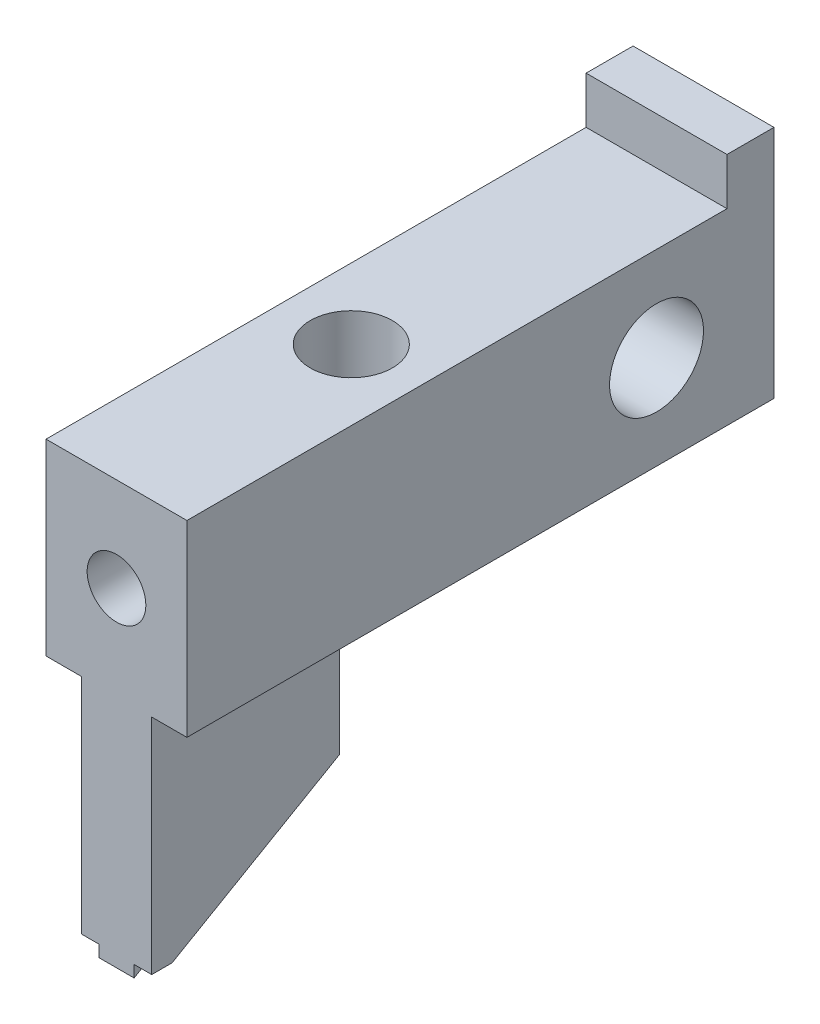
from build123d import *

# Parameters (mm, degrees)
EXTRUDE_1_DEPTH     = 25
SKETCH_2_R          = 1.25
CUT_EXTRUDE_1_DEPTH = 15
SKETCH_3_OUTSIDE_W  = 33.514
SKETCH_3_OUTSIDE_H  = 28.514
SKETCH_3_OUTSIDE_R  = 2
CUT_EXTRUDE_2_DEPTH = 15
SKETCH_4_R          = 1.75
CUT_EXTRUDE_3_DEPTH = 3


with BuildPart() as part:
    # Sketch 1 → Extrude 1 (new body)
    with BuildSketch(Plane.XY):
        Polygon((0, 20), (6, 20), (6, 10), (4.5, 10), (4.5, 0.5), (3.75, 0.5), (3.75, 0), (2.25, 0), (2.25, 0.5), (1.5, 0.5), (1.5, 10), (0, 10), align=None)
    extrude(amount=EXTRUDE_1_DEPTH)

    # Sketch 2 → Cut-Extrude 1 (cut)
    with BuildSketch(Plane.XY.offset(25)):
        with Locations((3, 14)):
            Circle(SKETCH_2_R)
    extrude(amount=-CUT_EXTRUDE_1_DEPTH, mode=Mode.SUBTRACT)

    # Sketch 3 outside → Cut-Extrude 2 (cut)
    # profile 1 of 2: a face of its own
    with BuildSketch(Plane(origin=(6, 0, 0), x_dir=(0, 0, -1), z_dir=(1, 0, 0))):
        with Locations((-12.5, 10)):
            Rectangle(SKETCH_3_OUTSIDE_W, SKETCH_3_OUTSIDE_H)
        Polygon((-25, 0), (-25, 18), (-2, 18), (-2, 20), (0, 20), (0, 10), (-17, 10), (-17, 4.618802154), align=None, mode=Mode.SUBTRACT)
    # profile 2 of 2: a face of its own
    with BuildSketch(Plane(origin=(6, 0, 0), x_dir=(0, 0, -1), z_dir=(1, 0, 0))):
        with Locations((-5, 14)):
            Circle(SKETCH_3_OUTSIDE_R)
    extrude(amount=-CUT_EXTRUDE_2_DEPTH, mode=Mode.SUBTRACT)

    # Sketch 4 → Cut-Extrude 3 (cut)
    with BuildSketch(Plane(origin=(0, 18, 0), x_dir=(1, 0, 0), z_dir=(0, 1, 0))):
        with Locations(Location((3, -15, 0), (0, 0, 270))):
            Circle(SKETCH_4_R)
    extrude(amount=-CUT_EXTRUDE_3_DEPTH, mode=Mode.SUBTRACT)


solid = part.part
